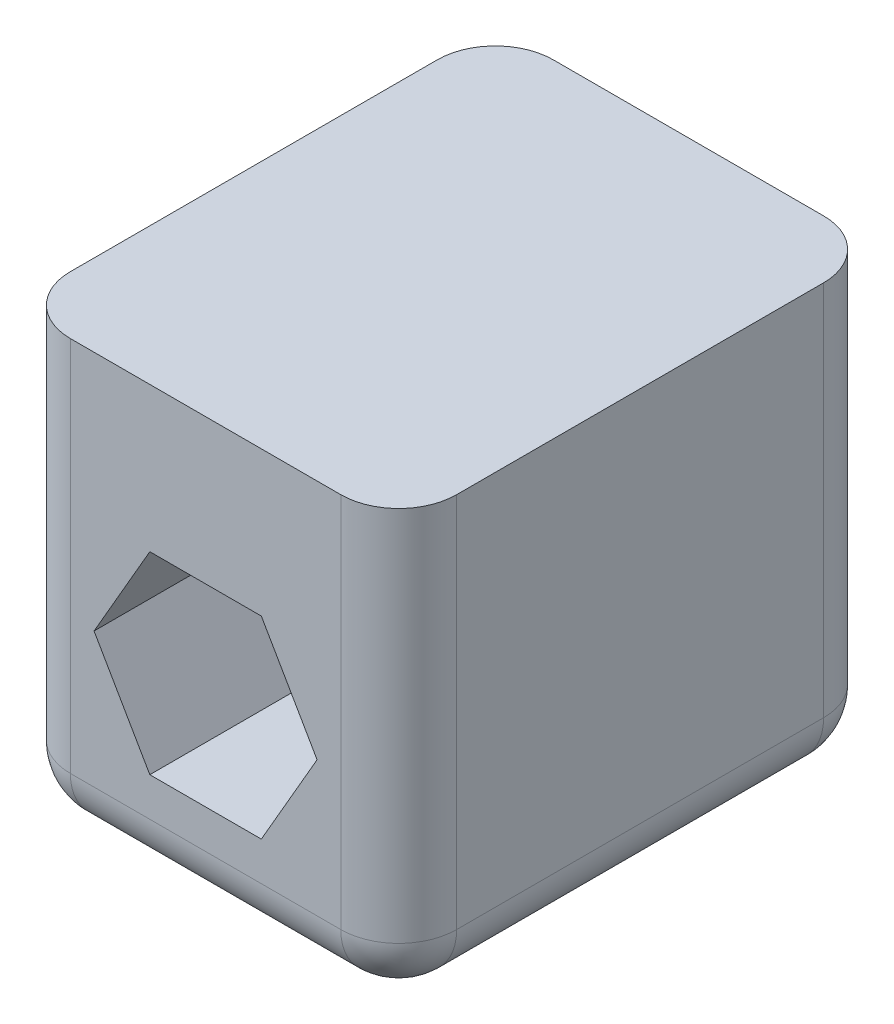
from build123d import *

# Parameters (mm, degrees)
SKETCH1_R           = 3.2
BOSS_EXTRUDE1_DEPTH = 25
CUT_EXTRUDE1_DEPTH  = 10
FILLET2_R           = 3


with BuildPart() as part:
    # Sketch1 → Boss-Extrude1 (new body)
    with BuildSketch(Plane.XY):
        Polygon((-10, -10), (10, -10), (10, 12.500000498), (-10, 12.499999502), align=None)
        Circle(SKETCH1_R, mode=Mode.SUBTRACT)
    extrude(amount=BOSS_EXTRUDE1_DEPTH)

    # Sketch2 → Cut-Extrude1 (cut)
    with BuildSketch(Plane.XY.offset(25)):
        Polygon((5.773502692, 0), (2.886751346, 5), (-2.886751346, 5), (-5.773502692, 0), (-2.886751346, -5), (2.886751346, -5), align=None)
    extrude(amount=-CUT_EXTRUDE1_DEPTH, mode=Mode.SUBTRACT)

    # Fillet2
    fillet2_edges = [part.edges().sort_by_distance(p)[0] for p in [
        (-10, 1.249999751, 25),
        (0, -10, 25),
        (10, 1.250000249, 25),
        (0, -10, 0),
        (-10, 1.249999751, 0),
        (10, 1.250000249, 0),
        (10, -10, 12.5),
        (-10, -10, 12.5),
    ]]
    fillet(fillet2_edges, radius=FILLET2_R)


solid = part.part
